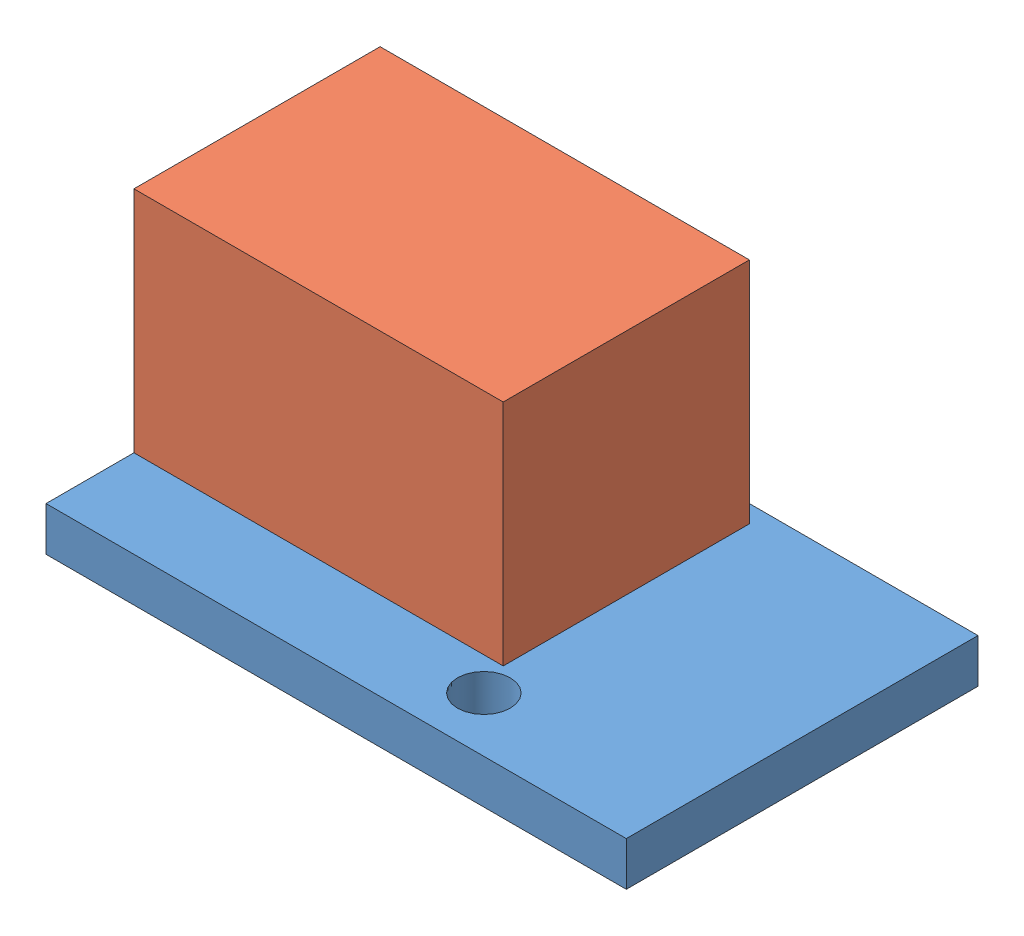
SolidWorks assembly Assem4.sldasm, configuration Default (file format 13000). Lengths in mm.
Overall size (33 15.5 20).
2 component instances, 2 part files, 3 mates.
Components (placement in the parent):
- Small-board-1: Small-board.SLDPRT [Default] at origin size (33 2.5 20)
- 8 pin header-1: 8 pin header.SLDPRT [Default] at (-6.5071 9 5.7163) x (-1 0 0) z (0 0 -1) size (21 13 14)
Mates (geometry in assembly coordinates):
- Coincident1: coincident: plane of Small-board-1 through (0 2.5 0) normal (0 1 0); plane of 8 pin header-1 through (3.9929 2.5 -8.2837) normal (0 -1 0)
- Coincident2: coincident: plane of Small-board-1 through (-17.0071 2.5 -9.2837) normal (-1 0 0); plane of 8 pin header-1 through (-17.0071 15.5 -8.2837) normal (-1 0 0)
- Distance1: distance = 1 mm aligned: plane of 8 pin header-1 through (-6.5071 9 -8.2837) normal (0 0 -1); plane of Small-board-1 through (-17.0071 2.5 -9.2837) normal (0 0 -1)
